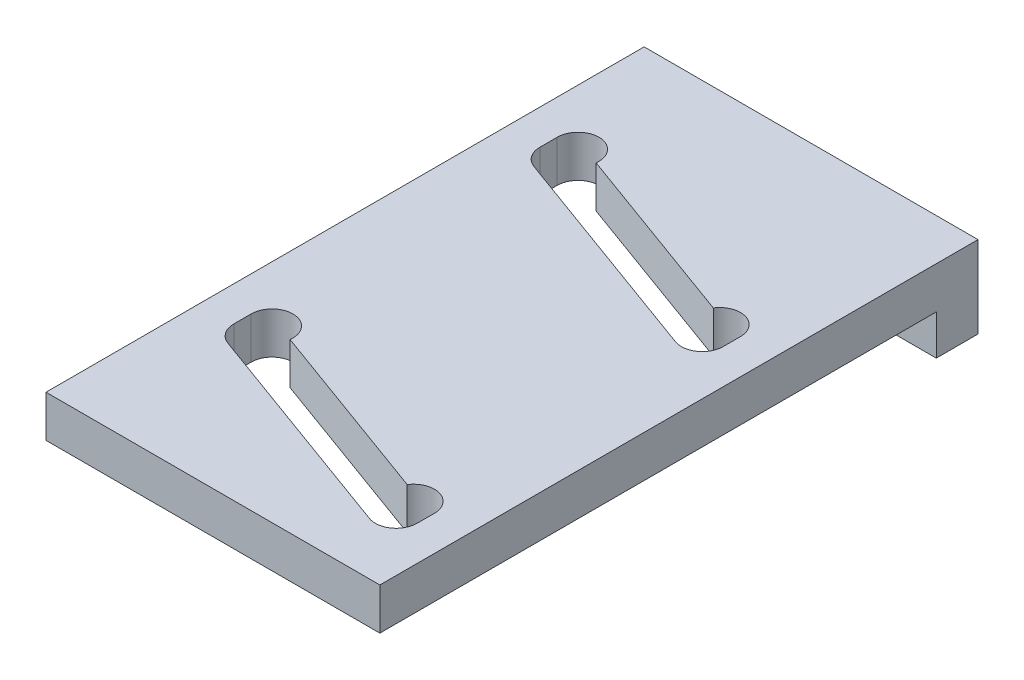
ISO-10303-21;
HEADER;
FILE_DESCRIPTION(('STEP AP214'),'2;1');
FILE_NAME('part.step','',(''),(''),'','','');
FILE_SCHEMA(('AUTOMOTIVE_DESIGN { 1 0 10303 214 1 1 1 1 }'));
ENDSEC;
DATA;
#1=APPLICATION_CONTEXT('core data for automotive mechanical design processes');
#2=APPLICATION_PROTOCOL_DEFINITION('international standard','automotive_design',2000,#1);
#3=PRODUCT_CONTEXT('',#1,'mechanical');
#4=PRODUCT('Part','Part','',(#3));
#5=PRODUCT_RELATED_PRODUCT_CATEGORY('part','',(#4));
#6=PRODUCT_DEFINITION_FORMATION('','',#4);
#7=PRODUCT_DEFINITION_CONTEXT('part definition',#1,'design');
#8=PRODUCT_DEFINITION('design','',#6,#7);
#9=PRODUCT_DEFINITION_SHAPE('','',#8);
#10=(LENGTH_UNIT() NAMED_UNIT(*) SI_UNIT(.MILLI.,.METRE.));
#11=(NAMED_UNIT(*) PLANE_ANGLE_UNIT() SI_UNIT($,.RADIAN.));
#12=(NAMED_UNIT(*) SI_UNIT($,.STERADIAN.) SOLID_ANGLE_UNIT());
#13=UNCERTAINTY_MEASURE_WITH_UNIT(LENGTH_MEASURE(1.E-05),#10,'distance_accuracy_value','');
#14=(GEOMETRIC_REPRESENTATION_CONTEXT(3) GLOBAL_UNCERTAINTY_ASSIGNED_CONTEXT((#13)) GLOBAL_UNIT_ASSIGNED_CONTEXT((#10,
#11,#12)) REPRESENTATION_CONTEXT('',''));
#15=CARTESIAN_POINT('',(0.,0.,0.));
#16=DIRECTION('',(0.,0.,1.));
#17=DIRECTION('',(1.,0.,0.));
#18=AXIS2_PLACEMENT_3D('',#15,#16,#17);
#19=CARTESIAN_POINT('',(-25.4,-4.7625,-34.925));
#20=DIRECTION('',(0.,1.,0.));
#21=DIRECTION('',(0.,0.,1.));
#22=AXIS2_PLACEMENT_3D('',#19,#20,#21);
#23=CYLINDRICAL_SURFACE('',#22,4.7625000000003);
#24=DIRECTION('',(0.,1.,0.));
#25=VECTOR('',#24,1.);
#26=CARTESIAN_POINT('',(-30.1625000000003,-4.7625,-34.925));
#27=LINE('',#26,#25);
#28=CARTESIAN_POINT('',(-30.1625000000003,-4.7625,-34.925));
#29=VERTEX_POINT('',#28);
#30=CARTESIAN_POINT('',(-30.1625000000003,4.7625,-34.925));
#31=VERTEX_POINT('',#30);
#32=EDGE_CURVE('E307',#29,#31,#27,.T.);
#33=ORIENTED_EDGE('',*,*,#32,.T.);
#34=CARTESIAN_POINT('',(-25.4,4.7625,-34.925));
#35=DIRECTION('',(0.,1.,0.));
#36=DIRECTION('',(0.,0.,-1.));
#37=AXIS2_PLACEMENT_3D('',#34,#35,#36);
#38=CIRCLE('',#37,4.7625000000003);
#39=CARTESIAN_POINT('',(-27.0288709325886,4.7625,-30.4497138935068));
#40=VERTEX_POINT('',#39);
#41=EDGE_CURVE('E337',#31,#40,#38,.T.);
#42=ORIENTED_EDGE('',*,*,#41,.T.);
#43=DIRECTION('',(0.,1.,0.));
#44=VECTOR('',#43,1.);
#45=CARTESIAN_POINT('',(-27.0288709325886,-4.7625,-30.4497138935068));
#46=LINE('',#45,#44);
#47=CARTESIAN_POINT('',(-27.0288709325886,-4.7625,-30.4497138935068));
#48=VERTEX_POINT('',#47);
#49=EDGE_CURVE('E354',#48,#40,#46,.T.);
#50=ORIENTED_EDGE('',*,*,#49,.F.);
#51=CARTESIAN_POINT('',(-25.4,-4.7625,-34.925));
#52=DIRECTION('',(0.,1.,0.));
#53=DIRECTION('',(0.,0.,-1.));
#54=AXIS2_PLACEMENT_3D('',#51,#52,#53);
#55=CIRCLE('',#54,4.7625000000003);
#56=EDGE_CURVE('E342',#29,#48,#55,.T.);
#57=ORIENTED_EDGE('',*,*,#56,.F.);
#58=EDGE_LOOP('',(#33,#42,#50,#57));
#59=FACE_BOUND('',#58,.T.);
#60=ADVANCED_FACE('F39',(#59),#23,.F.);
#61=CARTESIAN_POINT('',(-25.4,-4.7625,-104.775));
#62=DIRECTION('',(0.,1.,0.));
#63=DIRECTION('',(0.,0.,1.));
#64=AXIS2_PLACEMENT_3D('',#61,#62,#63);
#65=CYLINDRICAL_SURFACE('',#64,4.76250000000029);
#66=DIRECTION('',(0.,1.,0.));
#67=VECTOR('',#66,1.);
#68=CARTESIAN_POINT('',(-30.1625000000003,-4.7625,-104.775));
#69=LINE('',#68,#67);
#70=CARTESIAN_POINT('',(-30.1625000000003,-4.7625,-104.775));
#71=VERTEX_POINT('',#70);
#72=CARTESIAN_POINT('',(-30.1625000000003,4.7625,-104.775));
#73=VERTEX_POINT('',#72);
#74=EDGE_CURVE('E338',#71,#73,#69,.T.);
#75=ORIENTED_EDGE('',*,*,#74,.T.);
#76=CARTESIAN_POINT('',(-25.4,4.7625,-104.775));
#77=DIRECTION('',(0.,1.,0.));
#78=DIRECTION('',(0.,0.,-1.));
#79=AXIS2_PLACEMENT_3D('',#76,#77,#78);
#80=CIRCLE('',#79,4.76250000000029);
#81=CARTESIAN_POINT('',(-27.0288709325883,4.7625,-100.299713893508));
#82=VERTEX_POINT('',#81);
#83=EDGE_CURVE('E366',#73,#82,#80,.T.);
#84=ORIENTED_EDGE('',*,*,#83,.T.);
#85=DIRECTION('',(0.,1.,0.));
#86=VECTOR('',#85,1.);
#87=CARTESIAN_POINT('',(-27.0288709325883,-4.7625,-100.299713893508));
#88=LINE('',#87,#86);
#89=CARTESIAN_POINT('',(-27.0288709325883,-4.7625,-100.299713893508));
#90=VERTEX_POINT('',#89);
#91=EDGE_CURVE('E380',#90,#82,#88,.T.);
#92=ORIENTED_EDGE('',*,*,#91,.F.);
#93=CARTESIAN_POINT('',(-25.4,-4.7625,-104.775));
#94=DIRECTION('',(0.,1.,0.));
#95=DIRECTION('',(0.,0.,-1.));
#96=AXIS2_PLACEMENT_3D('',#93,#94,#95);
#97=CIRCLE('',#96,4.76250000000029);
#98=EDGE_CURVE('E369',#71,#90,#97,.T.);
#99=ORIENTED_EDGE('',*,*,#98,.F.);
#100=EDGE_LOOP('',(#75,#84,#92,#99));
#101=FACE_BOUND('',#100,.T.);
#102=ADVANCED_FACE('F445',(#101),#65,.F.);
#103=CARTESIAN_POINT('',(-38.1,4.7625,-127.));
#104=DIRECTION('',(1.,0.,0.));
#105=DIRECTION('',(0.,0.,-1.));
#106=AXIS2_PLACEMENT_3D('',#103,#104,#105);
#107=PLANE('',#106);
#108=DIRECTION('',(0.,0.,1.));
#109=VECTOR('',#108,1.);
#110=CARTESIAN_POINT('',(-38.1,-4.7625,-127.));
#111=LINE('',#110,#109);
#112=CARTESIAN_POINT('',(-38.1,-4.7625,-127.));
#113=VERTEX_POINT('',#112);
#114=CARTESIAN_POINT('',(-38.1,-4.7625,0.));
#115=VERTEX_POINT('',#114);
#116=EDGE_CURVE('E391',#113,#115,#111,.T.);
#117=ORIENTED_EDGE('',*,*,#116,.T.);
#118=DIRECTION('',(0.,-1.,0.));
#119=VECTOR('',#118,1.);
#120=CARTESIAN_POINT('',(-38.1,4.7625,0.));
#121=LINE('',#120,#119);
#122=CARTESIAN_POINT('',(-38.1,4.7625,0.));
#123=VERTEX_POINT('',#122);
#124=EDGE_CURVE('E217',#123,#115,#121,.T.);
#125=ORIENTED_EDGE('',*,*,#124,.F.);
#126=DIRECTION('',(0.,0.,1.));
#127=VECTOR('',#126,1.);
#128=CARTESIAN_POINT('',(-38.1,4.7625,-127.));
#129=LINE('',#128,#127);
#130=CARTESIAN_POINT('',(-38.1,4.7625,-136.525));
#131=VERTEX_POINT('',#130);
#132=EDGE_CURVE('E210',#131,#123,#129,.T.);
#133=ORIENTED_EDGE('',*,*,#132,.F.);
#134=DIRECTION('',(0.,1.,0.));
#135=VECTOR('',#134,1.);
#136=CARTESIAN_POINT('',(-38.1,4.7625,-136.525));
#137=LINE('',#136,#135);
#138=CARTESIAN_POINT('',(-38.1,-13.9065,-136.525));
#139=VERTEX_POINT('',#138);
#140=EDGE_CURVE('E215',#139,#131,#137,.T.);
#141=ORIENTED_EDGE('',*,*,#140,.F.);
#142=DIRECTION('',(0.,0.,1.));
#143=VECTOR('',#142,1.);
#144=CARTESIAN_POINT('',(-38.1,-13.9065,-136.525));
#145=LINE('',#144,#143);
#146=CARTESIAN_POINT('',(-38.1,-13.9065,-127.));
#147=VERTEX_POINT('',#146);
#148=EDGE_CURVE('E248',#139,#147,#145,.T.);
#149=ORIENTED_EDGE('',*,*,#148,.T.);
#150=DIRECTION('',(0.,1.,0.));
#151=VECTOR('',#150,1.);
#152=CARTESIAN_POINT('',(-38.1,4.7625,-127.));
#153=LINE('',#152,#151);
#154=EDGE_CURVE('E253',#147,#113,#153,.T.);
#155=ORIENTED_EDGE('',*,*,#154,.T.);
#156=EDGE_LOOP('',(#117,#125,#133,#141,#149,#155));
#157=FACE_BOUND('',#156,.T.);
#158=ADVANCED_FACE('F41',(#157),#107,.F.);
#159=CARTESIAN_POINT('',(-38.1,4.7625,0.));
#160=DIRECTION('',(0.,0.,-1.));
#161=DIRECTION('',(-1.,0.,0.));
#162=AXIS2_PLACEMENT_3D('',#159,#160,#161);
#163=PLANE('',#162);
#164=DIRECTION('',(1.,0.,0.));
#165=VECTOR('',#164,1.);
#166=CARTESIAN_POINT('',(-38.1,-4.7625,0.));
#167=LINE('',#166,#165);
#168=CARTESIAN_POINT('',(38.1,-4.7625,0.));
#169=VERTEX_POINT('',#168);
#170=EDGE_CURVE('E397',#115,#169,#167,.T.);
#171=ORIENTED_EDGE('',*,*,#170,.T.);
#172=DIRECTION('',(0.,-1.,0.));
#173=VECTOR('',#172,1.);
#174=CARTESIAN_POINT('',(38.1,4.7625,0.));
#175=LINE('',#174,#173);
#176=CARTESIAN_POINT('',(38.1,4.7625,0.));
#177=VERTEX_POINT('',#176);
#178=EDGE_CURVE('E396',#177,#169,#175,.T.);
#179=ORIENTED_EDGE('',*,*,#178,.F.);
#180=DIRECTION('',(1.,0.,0.));
#181=VECTOR('',#180,1.);
#182=CARTESIAN_POINT('',(-38.1,4.7625,0.));
#183=LINE('',#182,#181);
#184=EDGE_CURVE('E220',#123,#177,#183,.T.);
#185=ORIENTED_EDGE('',*,*,#184,.F.);
#186=ORIENTED_EDGE('',*,*,#124,.T.);
#187=EDGE_LOOP('',(#171,#179,#185,#186));
#188=FACE_BOUND('',#187,.T.);
#189=ADVANCED_FACE('F438',(#188),#163,.F.);
#190=CARTESIAN_POINT('',(38.1,4.7625,-127.));
#191=DIRECTION('',(-1.,0.,0.));
#192=DIRECTION('',(0.,0.,1.));
#193=AXIS2_PLACEMENT_3D('',#190,#191,#192);
#194=PLANE('',#193);
#195=DIRECTION('',(0.,0.,-1.));
#196=VECTOR('',#195,1.);
#197=CARTESIAN_POINT('',(38.1,-4.7625,-127.));
#198=LINE('',#197,#196);
#199=CARTESIAN_POINT('',(38.1,-4.7625,-127.));
#200=VERTEX_POINT('',#199);
#201=EDGE_CURVE('E399',#169,#200,#198,.T.);
#202=ORIENTED_EDGE('',*,*,#201,.T.);
#203=DIRECTION('',(0.,-1.,0.));
#204=VECTOR('',#203,1.);
#205=CARTESIAN_POINT('',(38.1,4.76249999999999,-127.));
#206=LINE('',#205,#204);
#207=CARTESIAN_POINT('',(38.1,-13.9065,-127.));
#208=VERTEX_POINT('',#207);
#209=EDGE_CURVE('E242',#200,#208,#206,.T.);
#210=ORIENTED_EDGE('',*,*,#209,.T.);
#211=DIRECTION('',(0.,0.,1.));
#212=VECTOR('',#211,1.);
#213=CARTESIAN_POINT('',(38.1,-13.9065,-136.525));
#214=LINE('',#213,#212);
#215=CARTESIAN_POINT('',(38.1,-13.9065,-136.525));
#216=VERTEX_POINT('',#215);
#217=EDGE_CURVE('E258',#216,#208,#214,.T.);
#218=ORIENTED_EDGE('',*,*,#217,.F.);
#219=DIRECTION('',(0.,-1.,0.));
#220=VECTOR('',#219,1.);
#221=CARTESIAN_POINT('',(38.1,4.76249999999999,-136.525));
#222=LINE('',#221,#220);
#223=CARTESIAN_POINT('',(38.1,4.76249999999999,-136.525));
#224=VERTEX_POINT('',#223);
#225=EDGE_CURVE('E231',#224,#216,#222,.T.);
#226=ORIENTED_EDGE('',*,*,#225,.F.);
#227=DIRECTION('',(0.,0.,-1.));
#228=VECTOR('',#227,1.);
#229=CARTESIAN_POINT('',(38.1,4.7625,-127.));
#230=LINE('',#229,#228);
#231=EDGE_CURVE('E227',#177,#224,#230,.T.);
#232=ORIENTED_EDGE('',*,*,#231,.F.);
#233=ORIENTED_EDGE('',*,*,#178,.T.);
#234=EDGE_LOOP('',(#202,#210,#218,#226,#232,#233));
#235=FACE_BOUND('',#234,.T.);
#236=ADVANCED_FACE('F413',(#235),#194,.F.);
#237=CARTESIAN_POINT('',(0.,4.7625,0.));
#238=DIRECTION('',(0.,1.,0.));
#239=DIRECTION('',(0.,0.,1.));
#240=AXIS2_PLACEMENT_3D('',#237,#238,#239);
#241=PLANE('',#240);
#242=CARTESIAN_POINT('',(25.400000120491,4.7625,-20.4040620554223));
#243=DIRECTION('',(0.,1.,0.));
#244=DIRECTION('',(0.,0.,-1.));
#245=AXIS2_PLACEMENT_3D('',#242,#243,#244);
#246=CIRCLE('',#245,4.76250000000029);
#247=CARTESIAN_POINT('',(30.1625001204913,4.7625,-20.4040620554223));
#248=VERTEX_POINT('',#247);
#249=CARTESIAN_POINT('',(21.3846154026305,4.7625,-22.9649392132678));
#250=VERTEX_POINT('',#249);
#251=EDGE_CURVE('E263',#248,#250,#246,.T.);
#252=ORIENTED_EDGE('',*,*,#251,.F.);
#253=DIRECTION('',(0.,0.,-1.));
#254=VECTOR('',#253,1.);
#255=CARTESIAN_POINT('',(30.1625001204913,4.7625,-20.4040620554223));
#256=LINE('',#255,#254);
#257=CARTESIAN_POINT('',(30.1625001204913,4.7625,-16.4353120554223));
#258=VERTEX_POINT('',#257);
#259=EDGE_CURVE('E267',#258,#248,#256,.T.);
#260=ORIENTED_EDGE('',*,*,#259,.F.);
#261=CARTESIAN_POINT('',(25.4,4.7625,-16.4353120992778));
#262=DIRECTION('',(0.,1.,0.));
#263=DIRECTION('',(0.,0.,1.));
#264=AXIS2_PLACEMENT_3D('',#261,#262,#263);
#265=CIRCLE('',#264,4.76250000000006);
#266=CARTESIAN_POINT('',(23.7711290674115,4.7625,-11.9600259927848));
#267=VERTEX_POINT('',#266);
#268=EDGE_CURVE('E359',#267,#258,#265,.T.);
#269=ORIENTED_EDGE('',*,*,#268,.F.);
#270=DIRECTION('',(0.939692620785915,0.,0.342020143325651));
#271=VECTOR('',#270,1.);
#272=CARTESIAN_POINT('',(23.7711290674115,4.7625,-11.9600259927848));
#273=LINE('',#272,#271);
#274=EDGE_CURVE('E356',#40,#267,#273,.T.);
#275=ORIENTED_EDGE('',*,*,#274,.F.);
#276=ORIENTED_EDGE('',*,*,#41,.F.);
#277=DIRECTION('',(0.,0.,1.));
#278=VECTOR('',#277,1.);
#279=CARTESIAN_POINT('',(-30.1625000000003,4.7625,-34.925));
#280=LINE('',#279,#278);
#281=CARTESIAN_POINT('',(-30.1625000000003,4.7625,-38.89375));
#282=VERTEX_POINT('',#281);
#283=EDGE_CURVE('E293',#282,#31,#280,.T.);
#284=ORIENTED_EDGE('',*,*,#283,.F.);
#285=CARTESIAN_POINT('',(-25.4,4.7625,-38.89375));
#286=DIRECTION('',(0.,1.,0.));
#287=DIRECTION('',(0.,0.,-1.));
#288=AXIS2_PLACEMENT_3D('',#285,#286,#287);
#289=CIRCLE('',#288,4.76250000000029);
#290=CARTESIAN_POINT('',(-20.6374999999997,4.7625,-38.89375));
#291=VERTEX_POINT('',#290);
#292=EDGE_CURVE('E302',#291,#282,#289,.T.);
#293=ORIENTED_EDGE('',*,*,#292,.F.);
#294=DIRECTION('',(0.,0.,-1.));
#295=VECTOR('',#294,1.);
#296=CARTESIAN_POINT('',(-20.6374999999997,4.7625,-38.89375));
#297=LINE('',#296,#295);
#298=CARTESIAN_POINT('',(-20.6374999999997,4.7625,-38.259738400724));
#299=VERTEX_POINT('',#298);
#300=EDGE_CURVE('E286',#299,#291,#297,.T.);
#301=ORIENTED_EDGE('',*,*,#300,.F.);
#302=DIRECTION('',(-0.939692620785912,0.,-0.342020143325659));
#303=VECTOR('',#302,1.);
#304=CARTESIAN_POINT('',(-23.7711290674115,4.7625,-39.4002861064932));
#305=LINE('',#304,#303);
#306=EDGE_CURVE('E345',#250,#299,#305,.T.);
#307=ORIENTED_EDGE('',*,*,#306,.F.);
#308=EDGE_LOOP('',(#252,#260,#269,#275,#276,#284,#293,#301,#307));
#309=FACE_BOUND('',#308,.T.);
#310=CARTESIAN_POINT('',(25.400000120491,4.7625,-90.2540620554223));
#311=DIRECTION('',(0.,1.,0.));
#312=DIRECTION('',(0.,0.,-1.));
#313=AXIS2_PLACEMENT_3D('',#310,#311,#312);
#314=CIRCLE('',#313,4.7625000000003);
#315=CARTESIAN_POINT('',(30.1625001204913,4.7625,-90.2540620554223));
#316=VERTEX_POINT('',#315);
#317=CARTESIAN_POINT('',(21.3846154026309,4.7625,-92.8149392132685));
#318=VERTEX_POINT('',#317);
#319=EDGE_CURVE('E273',#316,#318,#314,.T.);
#320=ORIENTED_EDGE('',*,*,#319,.F.);
#321=DIRECTION('',(0.,0.,-1.));
#322=VECTOR('',#321,1.);
#323=CARTESIAN_POINT('',(30.1625001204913,4.7625,-86.2853120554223));
#324=LINE('',#323,#322);
#325=CARTESIAN_POINT('',(30.1625001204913,4.7625,-86.2853120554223));
#326=VERTEX_POINT('',#325);
#327=EDGE_CURVE('E278',#326,#316,#324,.T.);
#328=ORIENTED_EDGE('',*,*,#327,.F.);
#329=CARTESIAN_POINT('',(25.4000000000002,4.7625,-86.2853120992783));
#330=DIRECTION('',(0.,1.,0.));
#331=DIRECTION('',(0.,0.,-1.));
#332=AXIS2_PLACEMENT_3D('',#329,#330,#331);
#333=CIRCLE('',#332,4.7625000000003);
#334=CARTESIAN_POINT('',(23.7711290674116,4.7625,-81.8100259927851));
#335=VERTEX_POINT('',#334);
#336=EDGE_CURVE('E385',#335,#326,#333,.T.);
#337=ORIENTED_EDGE('',*,*,#336,.F.);
#338=DIRECTION('',(0.939692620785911,0.,0.342020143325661));
#339=VECTOR('',#338,1.);
#340=CARTESIAN_POINT('',(23.7711290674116,4.7625,-81.8100259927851));
#341=LINE('',#340,#339);
#342=EDGE_CURVE('E382',#82,#335,#341,.T.);
#343=ORIENTED_EDGE('',*,*,#342,.F.);
#344=ORIENTED_EDGE('',*,*,#83,.F.);
#345=DIRECTION('',(0.,0.,1.));
#346=VECTOR('',#345,1.);
#347=CARTESIAN_POINT('',(-30.1625000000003,4.7625,-108.74375));
#348=LINE('',#347,#346);
#349=CARTESIAN_POINT('',(-30.1625000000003,4.7625,-108.74375));
#350=VERTEX_POINT('',#349);
#351=EDGE_CURVE('E331',#350,#73,#348,.T.);
#352=ORIENTED_EDGE('',*,*,#351,.F.);
#353=CARTESIAN_POINT('',(-25.4,4.7625,-108.74375));
#354=DIRECTION('',(0.,1.,0.));
#355=DIRECTION('',(0.,0.,-1.));
#356=AXIS2_PLACEMENT_3D('',#353,#354,#355);
#357=CIRCLE('',#356,4.7625000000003);
#358=CARTESIAN_POINT('',(-20.6374999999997,4.7625,-108.74375));
#359=VERTEX_POINT('',#358);
#360=EDGE_CURVE('E310',#359,#350,#357,.T.);
#361=ORIENTED_EDGE('',*,*,#360,.F.);
#362=DIRECTION('',(0.,0.,-1.));
#363=VECTOR('',#362,1.);
#364=CARTESIAN_POINT('',(-20.6374999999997,4.7625,-104.775));
#365=LINE('',#364,#363);
#366=CARTESIAN_POINT('',(-20.6374999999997,4.7625,-108.109738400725));
#367=VERTEX_POINT('',#366);
#368=EDGE_CURVE('E321',#367,#359,#365,.T.);
#369=ORIENTED_EDGE('',*,*,#368,.F.);
#370=DIRECTION('',(-0.939692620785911,0.,-0.34202014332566));
#371=VECTOR('',#370,1.);
#372=CARTESIAN_POINT('',(-23.7711290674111,4.7625,-109.250286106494));
#373=LINE('',#372,#371);
#374=EDGE_CURVE('E372',#318,#367,#373,.T.);
#375=ORIENTED_EDGE('',*,*,#374,.F.);
#376=EDGE_LOOP('',(#320,#328,#337,#343,#344,#352,#361,#369,#375));
#377=FACE_BOUND('',#376,.T.);
#378=ORIENTED_EDGE('',*,*,#132,.T.);
#379=ORIENTED_EDGE('',*,*,#184,.T.);
#380=ORIENTED_EDGE('',*,*,#231,.T.);
#381=DIRECTION('',(1.,0.,0.));
#382=VECTOR('',#381,1.);
#383=CARTESIAN_POINT('',(-38.1,4.7625,-136.525));
#384=LINE('',#383,#382);
#385=EDGE_CURVE('E224',#131,#224,#384,.T.);
#386=ORIENTED_EDGE('',*,*,#385,.F.);
#387=EDGE_LOOP('',(#378,#379,#380,#386));
#388=FACE_BOUND('',#387,.T.);
#389=ADVANCED_FACE('F225',(#309,#377,#388),#241,.T.);
#390=CARTESIAN_POINT('',(0.,-4.7625,0.));
#391=DIRECTION('',(0.,1.,0.));
#392=DIRECTION('',(0.,0.,1.));
#393=AXIS2_PLACEMENT_3D('',#390,#391,#392);
#394=PLANE('',#393);
#395=DIRECTION('',(0.,0.,-1.));
#396=VECTOR('',#395,1.);
#397=CARTESIAN_POINT('',(30.1625001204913,-4.7625,-20.4040620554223));
#398=LINE('',#397,#396);
#399=CARTESIAN_POINT('',(30.1625000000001,-4.7625,-16.4353120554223));
#400=VERTEX_POINT('',#399);
#401=CARTESIAN_POINT('',(30.1625001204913,-4.7625,-20.4040620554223));
#402=VERTEX_POINT('',#401);
#403=EDGE_CURVE('E56',#400,#402,#398,.T.);
#404=ORIENTED_EDGE('',*,*,#403,.T.);
#405=CARTESIAN_POINT('',(25.400000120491,-4.7625,-20.4040620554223));
#406=DIRECTION('',(0.,1.,0.));
#407=DIRECTION('',(0.,0.,-1.));
#408=AXIS2_PLACEMENT_3D('',#405,#406,#407);
#409=CIRCLE('',#408,4.76250000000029);
#410=CARTESIAN_POINT('',(21.3846154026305,-4.7625,-22.9649392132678));
#411=VERTEX_POINT('',#410);
#412=EDGE_CURVE('E262',#402,#411,#409,.T.);
#413=ORIENTED_EDGE('',*,*,#412,.T.);
#414=DIRECTION('',(-0.939692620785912,0.,-0.342020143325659));
#415=VECTOR('',#414,1.);
#416=CARTESIAN_POINT('',(-23.7711290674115,-4.7625,-39.4002861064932));
#417=LINE('',#416,#415);
#418=CARTESIAN_POINT('',(-20.6374999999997,-4.7625,-38.259738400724));
#419=VERTEX_POINT('',#418);
#420=EDGE_CURVE('E351',#411,#419,#417,.T.);
#421=ORIENTED_EDGE('',*,*,#420,.T.);
#422=DIRECTION('',(0.,0.,-1.));
#423=VECTOR('',#422,1.);
#424=CARTESIAN_POINT('',(-20.6374999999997,-4.7625,-38.89375));
#425=LINE('',#424,#423);
#426=CARTESIAN_POINT('',(-20.6374999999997,-4.7625,-38.89375));
#427=VERTEX_POINT('',#426);
#428=EDGE_CURVE('E288',#419,#427,#425,.T.);
#429=ORIENTED_EDGE('',*,*,#428,.T.);
#430=CARTESIAN_POINT('',(-25.4,-4.7625,-38.89375));
#431=DIRECTION('',(0.,1.,0.));
#432=DIRECTION('',(0.,0.,-1.));
#433=AXIS2_PLACEMENT_3D('',#430,#431,#432);
#434=CIRCLE('',#433,4.76250000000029);
#435=CARTESIAN_POINT('',(-30.1625000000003,-4.7625,-38.89375));
#436=VERTEX_POINT('',#435);
#437=EDGE_CURVE('E292',#427,#436,#434,.T.);
#438=ORIENTED_EDGE('',*,*,#437,.T.);
#439=DIRECTION('',(0.,0.,1.));
#440=VECTOR('',#439,1.);
#441=CARTESIAN_POINT('',(-30.1625000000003,-4.7625,-34.925));
#442=LINE('',#441,#440);
#443=EDGE_CURVE('E297',#436,#29,#442,.T.);
#444=ORIENTED_EDGE('',*,*,#443,.T.);
#445=ORIENTED_EDGE('',*,*,#56,.T.);
#446=DIRECTION('',(0.939692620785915,0.,0.342020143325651));
#447=VECTOR('',#446,1.);
#448=CARTESIAN_POINT('',(23.7711290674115,-4.7625,-11.9600259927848));
#449=LINE('',#448,#447);
#450=CARTESIAN_POINT('',(23.7711290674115,-4.7625,-11.9600259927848));
#451=VERTEX_POINT('',#450);
#452=EDGE_CURVE('E344',#48,#451,#449,.T.);
#453=ORIENTED_EDGE('',*,*,#452,.T.);
#454=CARTESIAN_POINT('',(25.4,-4.7625,-16.4353120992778));
#455=DIRECTION('',(0.,1.,0.));
#456=DIRECTION('',(0.,0.,1.));
#457=AXIS2_PLACEMENT_3D('',#454,#455,#456);
#458=CIRCLE('',#457,4.76250000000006);
#459=EDGE_CURVE('E348',#451,#400,#458,.T.);
#460=ORIENTED_EDGE('',*,*,#459,.T.);
#461=EDGE_LOOP('',(#404,#413,#421,#429,#438,#444,#445,#453,#460));
#462=FACE_BOUND('',#461,.T.);
#463=DIRECTION('',(0.,0.,-1.));
#464=VECTOR('',#463,1.);
#465=CARTESIAN_POINT('',(30.1625001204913,-4.7625,-86.2853120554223));
#466=LINE('',#465,#464);
#467=CARTESIAN_POINT('',(30.1625000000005,-4.7625,-86.2853120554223));
#468=VERTEX_POINT('',#467);
#469=CARTESIAN_POINT('',(30.1625001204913,-4.7625,-90.2540620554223));
#470=VERTEX_POINT('',#469);
#471=EDGE_CURVE('E64',#468,#470,#466,.T.);
#472=ORIENTED_EDGE('',*,*,#471,.T.);
#473=CARTESIAN_POINT('',(25.400000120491,-4.7625,-90.2540620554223));
#474=DIRECTION('',(0.,1.,0.));
#475=DIRECTION('',(0.,0.,-1.));
#476=AXIS2_PLACEMENT_3D('',#473,#474,#475);
#477=CIRCLE('',#476,4.7625000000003);
#478=CARTESIAN_POINT('',(21.3846154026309,-4.7625,-92.8149392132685));
#479=VERTEX_POINT('',#478);
#480=EDGE_CURVE('E275',#470,#479,#477,.T.);
#481=ORIENTED_EDGE('',*,*,#480,.T.);
#482=DIRECTION('',(-0.939692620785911,0.,-0.34202014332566));
#483=VECTOR('',#482,1.);
#484=CARTESIAN_POINT('',(-23.7711290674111,-4.7625,-109.250286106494));
#485=LINE('',#484,#483);
#486=CARTESIAN_POINT('',(-20.6374999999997,-4.7625,-108.109738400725));
#487=VERTEX_POINT('',#486);
#488=EDGE_CURVE('E378',#479,#487,#485,.T.);
#489=ORIENTED_EDGE('',*,*,#488,.T.);
#490=DIRECTION('',(0.,0.,-1.));
#491=VECTOR('',#490,1.);
#492=CARTESIAN_POINT('',(-20.6374999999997,-4.7625,-104.775));
#493=LINE('',#492,#491);
#494=CARTESIAN_POINT('',(-20.6374999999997,-4.7625,-108.74375));
#495=VERTEX_POINT('',#494);
#496=EDGE_CURVE('E324',#487,#495,#493,.T.);
#497=ORIENTED_EDGE('',*,*,#496,.T.);
#498=CARTESIAN_POINT('',(-25.4,-4.7625,-108.74375));
#499=DIRECTION('',(0.,1.,0.));
#500=DIRECTION('',(0.,0.,-1.));
#501=AXIS2_PLACEMENT_3D('',#498,#499,#500);
#502=CIRCLE('',#501,4.7625000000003);
#503=CARTESIAN_POINT('',(-30.1625000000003,-4.7625,-108.74375));
#504=VERTEX_POINT('',#503);
#505=EDGE_CURVE('E316',#495,#504,#502,.T.);
#506=ORIENTED_EDGE('',*,*,#505,.T.);
#507=DIRECTION('',(0.,0.,1.));
#508=VECTOR('',#507,1.);
#509=CARTESIAN_POINT('',(-30.1625000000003,-4.7625,-108.74375));
#510=LINE('',#509,#508);
#511=EDGE_CURVE('E320',#504,#71,#510,.T.);
#512=ORIENTED_EDGE('',*,*,#511,.T.);
#513=ORIENTED_EDGE('',*,*,#98,.T.);
#514=DIRECTION('',(0.939692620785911,0.,0.342020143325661));
#515=VECTOR('',#514,1.);
#516=CARTESIAN_POINT('',(23.7711290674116,-4.7625,-81.8100259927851));
#517=LINE('',#516,#515);
#518=CARTESIAN_POINT('',(23.7711290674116,-4.7625,-81.8100259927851));
#519=VERTEX_POINT('',#518);
#520=EDGE_CURVE('E371',#90,#519,#517,.T.);
#521=ORIENTED_EDGE('',*,*,#520,.T.);
#522=CARTESIAN_POINT('',(25.4000000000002,-4.7625,-86.2853120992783));
#523=DIRECTION('',(0.,1.,0.));
#524=DIRECTION('',(0.,0.,-1.));
#525=AXIS2_PLACEMENT_3D('',#522,#523,#524);
#526=CIRCLE('',#525,4.7625000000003);
#527=EDGE_CURVE('E375',#519,#468,#526,.T.);
#528=ORIENTED_EDGE('',*,*,#527,.T.);
#529=EDGE_LOOP('',(#472,#481,#489,#497,#506,#512,#513,#521,#528));
#530=FACE_BOUND('',#529,.T.);
#531=ORIENTED_EDGE('',*,*,#116,.F.);
#532=DIRECTION('',(-1.,0.,0.));
#533=VECTOR('',#532,1.);
#534=CARTESIAN_POINT('',(-38.1,-4.7625,-127.));
#535=LINE('',#534,#533);
#536=EDGE_CURVE('E221',#200,#113,#535,.T.);
#537=ORIENTED_EDGE('',*,*,#536,.F.);
#538=ORIENTED_EDGE('',*,*,#201,.F.);
#539=ORIENTED_EDGE('',*,*,#170,.F.);
#540=EDGE_LOOP('',(#531,#537,#538,#539));
#541=FACE_BOUND('',#540,.T.);
#542=ADVANCED_FACE('F419',(#462,#530,#541),#394,.F.);
#543=CARTESIAN_POINT('',(-23.7711290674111,-4.7625,-109.250286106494));
#544=DIRECTION('',(0.34202014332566,0.,-0.939692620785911));
#545=DIRECTION('',(-0.939692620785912,0.,-0.342020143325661));
#546=AXIS2_PLACEMENT_3D('',#543,#544,#545);
#547=PLANE('',#546);
#548=ORIENTED_EDGE('',*,*,#488,.F.);
#549=DIRECTION('',(0.,1.,0.));
#550=VECTOR('',#549,1.);
#551=CARTESIAN_POINT('',(21.3846154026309,-4.7625,-92.8149392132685));
#552=LINE('',#551,#550);
#553=EDGE_CURVE('E48',#479,#318,#552,.T.);
#554=ORIENTED_EDGE('',*,*,#553,.T.);
#555=ORIENTED_EDGE('',*,*,#374,.T.);
#556=DIRECTION('',(0.,-1.,0.));
#557=VECTOR('',#556,1.);
#558=CARTESIAN_POINT('',(-20.6374999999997,-4.7625,-108.109738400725));
#559=LINE('',#558,#557);
#560=EDGE_CURVE('E435',#367,#487,#559,.T.);
#561=ORIENTED_EDGE('',*,*,#560,.T.);
#562=EDGE_LOOP('',(#548,#554,#555,#561));
#563=FACE_BOUND('',#562,.T.);
#564=ADVANCED_FACE('F458',(#563),#547,.F.);
#565=CARTESIAN_POINT('',(25.4000000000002,-4.7625,-86.2853120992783));
#566=DIRECTION('',(0.,1.,0.));
#567=DIRECTION('',(0.,0.,1.));
#568=AXIS2_PLACEMENT_3D('',#565,#566,#567);
#569=CYLINDRICAL_SURFACE('',#568,4.7625000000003);
#570=ORIENTED_EDGE('',*,*,#336,.T.);
#571=DIRECTION('',(0.,1.,0.));
#572=VECTOR('',#571,1.);
#573=CARTESIAN_POINT('',(30.1625001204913,-4.7625,-86.2853120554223));
#574=LINE('',#573,#572);
#575=EDGE_CURVE('E280',#468,#326,#574,.T.);
#576=ORIENTED_EDGE('',*,*,#575,.F.);
#577=ORIENTED_EDGE('',*,*,#527,.F.);
#578=DIRECTION('',(0.,1.,0.));
#579=VECTOR('',#578,1.);
#580=CARTESIAN_POINT('',(23.7711290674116,-4.7625,-81.8100259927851));
#581=LINE('',#580,#579);
#582=EDGE_CURVE('E389',#519,#335,#581,.T.);
#583=ORIENTED_EDGE('',*,*,#582,.T.);
#584=EDGE_LOOP('',(#570,#576,#577,#583));
#585=FACE_BOUND('',#584,.T.);
#586=ADVANCED_FACE('F461',(#585),#569,.F.);
#587=CARTESIAN_POINT('',(23.7711290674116,-4.7625,-81.8100259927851));
#588=DIRECTION('',(-0.342020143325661,0.,0.939692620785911));
#589=DIRECTION('',(0.939692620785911,0.,0.342020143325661));
#590=AXIS2_PLACEMENT_3D('',#587,#588,#589);
#591=PLANE('',#590);
#592=ORIENTED_EDGE('',*,*,#342,.T.);
#593=ORIENTED_EDGE('',*,*,#582,.F.);
#594=ORIENTED_EDGE('',*,*,#520,.F.);
#595=ORIENTED_EDGE('',*,*,#91,.T.);
#596=EDGE_LOOP('',(#592,#593,#594,#595));
#597=FACE_BOUND('',#596,.T.);
#598=ADVANCED_FACE('F465',(#597),#591,.F.);
#599=CARTESIAN_POINT('',(-23.7711290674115,-4.7625,-39.4002861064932));
#600=DIRECTION('',(0.342020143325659,0.,-0.939692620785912));
#601=DIRECTION('',(-0.939692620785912,0.,-0.342020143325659));
#602=AXIS2_PLACEMENT_3D('',#599,#600,#601);
#603=PLANE('',#602);
#604=ORIENTED_EDGE('',*,*,#420,.F.);
#605=DIRECTION('',(0.,1.,0.));
#606=VECTOR('',#605,1.);
#607=CARTESIAN_POINT('',(21.3846154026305,-4.7625,-22.9649392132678));
#608=LINE('',#607,#606);
#609=EDGE_CURVE('E11',#411,#250,#608,.T.);
#610=ORIENTED_EDGE('',*,*,#609,.T.);
#611=ORIENTED_EDGE('',*,*,#306,.T.);
#612=DIRECTION('',(0.,-1.,0.));
#613=VECTOR('',#612,1.);
#614=CARTESIAN_POINT('',(-20.6374999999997,-4.7625,-38.259738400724));
#615=LINE('',#614,#613);
#616=EDGE_CURVE('E431',#299,#419,#615,.T.);
#617=ORIENTED_EDGE('',*,*,#616,.T.);
#618=EDGE_LOOP('',(#604,#610,#611,#617));
#619=FACE_BOUND('',#618,.T.);
#620=ADVANCED_FACE('F468',(#619),#603,.F.);
#621=CARTESIAN_POINT('',(25.4,-4.7625,-16.4353120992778));
#622=DIRECTION('',(0.,1.,0.));
#623=DIRECTION('',(0.,0.,1.));
#624=AXIS2_PLACEMENT_3D('',#621,#622,#623);
#625=CYLINDRICAL_SURFACE('',#624,4.76250000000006);
#626=ORIENTED_EDGE('',*,*,#268,.T.);
#627=DIRECTION('',(0.,1.,0.));
#628=VECTOR('',#627,1.);
#629=CARTESIAN_POINT('',(30.1625001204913,-4.7625,-16.4353120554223));
#630=LINE('',#629,#628);
#631=EDGE_CURVE('E266',#400,#258,#630,.T.);
#632=ORIENTED_EDGE('',*,*,#631,.F.);
#633=ORIENTED_EDGE('',*,*,#459,.F.);
#634=DIRECTION('',(0.,1.,0.));
#635=VECTOR('',#634,1.);
#636=CARTESIAN_POINT('',(23.7711290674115,-4.7625,-11.9600259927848));
#637=LINE('',#636,#635);
#638=EDGE_CURVE('E364',#451,#267,#637,.T.);
#639=ORIENTED_EDGE('',*,*,#638,.T.);
#640=EDGE_LOOP('',(#626,#632,#633,#639));
#641=FACE_BOUND('',#640,.T.);
#642=ADVANCED_FACE('F522',(#641),#625,.F.);
#643=CARTESIAN_POINT('',(23.7711290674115,-4.7625,-11.9600259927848));
#644=DIRECTION('',(-0.34202014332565,0.,0.939692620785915));
#645=DIRECTION('',(0.939692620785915,0.,0.34202014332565));
#646=AXIS2_PLACEMENT_3D('',#643,#644,#645);
#647=PLANE('',#646);
#648=ORIENTED_EDGE('',*,*,#274,.T.);
#649=ORIENTED_EDGE('',*,*,#638,.F.);
#650=ORIENTED_EDGE('',*,*,#452,.F.);
#651=ORIENTED_EDGE('',*,*,#49,.T.);
#652=EDGE_LOOP('',(#648,#649,#650,#651));
#653=FACE_BOUND('',#652,.T.);
#654=ADVANCED_FACE('F456',(#653),#647,.F.);
#655=CARTESIAN_POINT('',(-20.6374999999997,-4.7625,-104.775));
#656=DIRECTION('',(1.,0.,0.));
#657=DIRECTION('',(0.,0.,-1.));
#658=AXIS2_PLACEMENT_3D('',#655,#656,#657);
#659=PLANE('',#658);
#660=ORIENTED_EDGE('',*,*,#368,.T.);
#661=DIRECTION('',(0.,1.,0.));
#662=VECTOR('',#661,1.);
#663=CARTESIAN_POINT('',(-20.6374999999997,-4.7625,-108.74375));
#664=LINE('',#663,#662);
#665=EDGE_CURVE('E334',#495,#359,#664,.T.);
#666=ORIENTED_EDGE('',*,*,#665,.F.);
#667=ORIENTED_EDGE('',*,*,#496,.F.);
#668=ORIENTED_EDGE('',*,*,#560,.F.);
#669=EDGE_LOOP('',(#660,#666,#667,#668));
#670=FACE_BOUND('',#669,.T.);
#671=ADVANCED_FACE('F499',(#670),#659,.F.);
#672=CARTESIAN_POINT('',(-25.4,-4.7625,-108.74375));
#673=DIRECTION('',(0.,1.,0.));
#674=DIRECTION('',(0.,0.,1.));
#675=AXIS2_PLACEMENT_3D('',#672,#673,#674);
#676=CYLINDRICAL_SURFACE('',#675,4.7625000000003);
#677=ORIENTED_EDGE('',*,*,#360,.T.);
#678=DIRECTION('',(0.,1.,0.));
#679=VECTOR('',#678,1.);
#680=CARTESIAN_POINT('',(-30.1625000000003,-4.7625,-108.74375));
#681=LINE('',#680,#679);
#682=EDGE_CURVE('E327',#504,#350,#681,.T.);
#683=ORIENTED_EDGE('',*,*,#682,.F.);
#684=ORIENTED_EDGE('',*,*,#505,.F.);
#685=ORIENTED_EDGE('',*,*,#665,.T.);
#686=EDGE_LOOP('',(#677,#683,#684,#685));
#687=FACE_BOUND('',#686,.T.);
#688=ADVANCED_FACE('F503',(#687),#676,.F.);
#689=CARTESIAN_POINT('',(-30.1625000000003,-4.7625,-108.74375));
#690=DIRECTION('',(-1.,0.,0.));
#691=DIRECTION('',(0.,0.,1.));
#692=AXIS2_PLACEMENT_3D('',#689,#690,#691);
#693=PLANE('',#692);
#694=ORIENTED_EDGE('',*,*,#351,.T.);
#695=ORIENTED_EDGE('',*,*,#74,.F.);
#696=ORIENTED_EDGE('',*,*,#511,.F.);
#697=ORIENTED_EDGE('',*,*,#682,.T.);
#698=EDGE_LOOP('',(#694,#695,#696,#697));
#699=FACE_BOUND('',#698,.T.);
#700=ADVANCED_FACE('F507',(#699),#693,.F.);
#701=CARTESIAN_POINT('',(-20.6374999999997,-4.7625,-38.89375));
#702=DIRECTION('',(1.,0.,0.));
#703=DIRECTION('',(0.,0.,-1.));
#704=AXIS2_PLACEMENT_3D('',#701,#702,#703);
#705=PLANE('',#704);
#706=ORIENTED_EDGE('',*,*,#300,.T.);
#707=DIRECTION('',(0.,1.,0.));
#708=VECTOR('',#707,1.);
#709=CARTESIAN_POINT('',(-20.6374999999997,-4.7625,-38.89375));
#710=LINE('',#709,#708);
#711=EDGE_CURVE('E300',#427,#291,#710,.T.);
#712=ORIENTED_EDGE('',*,*,#711,.F.);
#713=ORIENTED_EDGE('',*,*,#428,.F.);
#714=ORIENTED_EDGE('',*,*,#616,.F.);
#715=EDGE_LOOP('',(#706,#712,#713,#714));
#716=FACE_BOUND('',#715,.T.);
#717=ADVANCED_FACE('F509',(#716),#705,.F.);
#718=CARTESIAN_POINT('',(-30.1625000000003,-4.7625,-34.925));
#719=DIRECTION('',(-1.,0.,0.));
#720=DIRECTION('',(0.,0.,1.));
#721=AXIS2_PLACEMENT_3D('',#718,#719,#720);
#722=PLANE('',#721);
#723=ORIENTED_EDGE('',*,*,#283,.T.);
#724=ORIENTED_EDGE('',*,*,#32,.F.);
#725=ORIENTED_EDGE('',*,*,#443,.F.);
#726=DIRECTION('',(0.,1.,0.));
#727=VECTOR('',#726,1.);
#728=CARTESIAN_POINT('',(-30.1625000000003,-4.7625,-38.89375));
#729=LINE('',#728,#727);
#730=EDGE_CURVE('E311',#436,#282,#729,.T.);
#731=ORIENTED_EDGE('',*,*,#730,.T.);
#732=EDGE_LOOP('',(#723,#724,#725,#731));
#733=FACE_BOUND('',#732,.T.);
#734=ADVANCED_FACE('F515',(#733),#722,.F.);
#735=CARTESIAN_POINT('',(-25.4,-4.7625,-38.89375));
#736=DIRECTION('',(0.,1.,0.));
#737=DIRECTION('',(0.,0.,1.));
#738=AXIS2_PLACEMENT_3D('',#735,#736,#737);
#739=CYLINDRICAL_SURFACE('',#738,4.76250000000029);
#740=ORIENTED_EDGE('',*,*,#292,.T.);
#741=ORIENTED_EDGE('',*,*,#730,.F.);
#742=ORIENTED_EDGE('',*,*,#437,.F.);
#743=ORIENTED_EDGE('',*,*,#711,.T.);
#744=EDGE_LOOP('',(#740,#741,#742,#743));
#745=FACE_BOUND('',#744,.T.);
#746=ADVANCED_FACE('F548',(#745),#739,.F.);
#747=CARTESIAN_POINT('',(25.400000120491,-4.7625,-90.2540620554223));
#748=DIRECTION('',(0.,1.,0.));
#749=DIRECTION('',(0.,0.,1.));
#750=AXIS2_PLACEMENT_3D('',#747,#748,#749);
#751=CYLINDRICAL_SURFACE('',#750,4.7625000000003);
#752=ORIENTED_EDGE('',*,*,#480,.F.);
#753=DIRECTION('',(0.,1.,0.));
#754=VECTOR('',#753,1.);
#755=CARTESIAN_POINT('',(30.1625001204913,-4.7625,-90.2540620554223));
#756=LINE('',#755,#754);
#757=EDGE_CURVE('E284',#470,#316,#756,.T.);
#758=ORIENTED_EDGE('',*,*,#757,.T.);
#759=ORIENTED_EDGE('',*,*,#319,.T.);
#760=ORIENTED_EDGE('',*,*,#553,.F.);
#761=EDGE_LOOP('',(#752,#758,#759,#760));
#762=FACE_BOUND('',#761,.T.);
#763=ADVANCED_FACE('F493',(#762),#751,.F.);
#764=CARTESIAN_POINT('',(30.1625001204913,-4.7625,-86.2853120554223));
#765=DIRECTION('',(1.,0.,0.));
#766=DIRECTION('',(0.,0.,-1.));
#767=AXIS2_PLACEMENT_3D('',#764,#765,#766);
#768=PLANE('',#767);
#769=ORIENTED_EDGE('',*,*,#327,.T.);
#770=ORIENTED_EDGE('',*,*,#757,.F.);
#771=ORIENTED_EDGE('',*,*,#471,.F.);
#772=ORIENTED_EDGE('',*,*,#575,.T.);
#773=EDGE_LOOP('',(#769,#770,#771,#772));
#774=FACE_BOUND('',#773,.T.);
#775=ADVANCED_FACE('F491',(#774),#768,.F.);
#776=CARTESIAN_POINT('',(25.400000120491,-4.7625,-20.4040620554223));
#777=DIRECTION('',(0.,1.,0.));
#778=DIRECTION('',(0.,0.,1.));
#779=AXIS2_PLACEMENT_3D('',#776,#777,#778);
#780=CYLINDRICAL_SURFACE('',#779,4.76250000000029);
#781=ORIENTED_EDGE('',*,*,#412,.F.);
#782=DIRECTION('',(0.,1.,0.));
#783=VECTOR('',#782,1.);
#784=CARTESIAN_POINT('',(30.1625001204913,-4.7625,-20.4040620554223));
#785=LINE('',#784,#783);
#786=EDGE_CURVE('E271',#402,#248,#785,.T.);
#787=ORIENTED_EDGE('',*,*,#786,.T.);
#788=ORIENTED_EDGE('',*,*,#251,.T.);
#789=ORIENTED_EDGE('',*,*,#609,.F.);
#790=EDGE_LOOP('',(#781,#787,#788,#789));
#791=FACE_BOUND('',#790,.T.);
#792=ADVANCED_FACE('F540',(#791),#780,.F.);
#793=CARTESIAN_POINT('',(30.1625001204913,-4.7625,-20.4040620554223));
#794=DIRECTION('',(1.,0.,0.));
#795=DIRECTION('',(0.,0.,-1.));
#796=AXIS2_PLACEMENT_3D('',#793,#794,#795);
#797=PLANE('',#796);
#798=ORIENTED_EDGE('',*,*,#259,.T.);
#799=ORIENTED_EDGE('',*,*,#786,.F.);
#800=ORIENTED_EDGE('',*,*,#403,.F.);
#801=ORIENTED_EDGE('',*,*,#631,.T.);
#802=EDGE_LOOP('',(#798,#799,#800,#801));
#803=FACE_BOUND('',#802,.T.);
#804=ADVANCED_FACE('F537',(#803),#797,.F.);
#805=CARTESIAN_POINT('',(-38.1,-13.9065,-136.525));
#806=DIRECTION('',(0.,1.,0.));
#807=DIRECTION('',(-1.,0.,0.));
#808=AXIS2_PLACEMENT_3D('',#805,#806,#807);
#809=PLANE('',#808);
#810=DIRECTION('',(-1.,0.,0.));
#811=VECTOR('',#810,1.);
#812=CARTESIAN_POINT('',(-38.1,-13.9065,-127.));
#813=LINE('',#812,#811);
#814=EDGE_CURVE('E238',#208,#147,#813,.T.);
#815=ORIENTED_EDGE('',*,*,#814,.T.);
#816=ORIENTED_EDGE('',*,*,#148,.F.);
#817=DIRECTION('',(-1.,0.,0.));
#818=VECTOR('',#817,1.);
#819=CARTESIAN_POINT('',(-38.1,-13.9065,-136.525));
#820=LINE('',#819,#818);
#821=EDGE_CURVE('E235',#216,#139,#820,.T.);
#822=ORIENTED_EDGE('',*,*,#821,.F.);
#823=ORIENTED_EDGE('',*,*,#217,.T.);
#824=EDGE_LOOP('',(#815,#816,#822,#823));
#825=FACE_BOUND('',#824,.T.);
#826=ADVANCED_FACE('F425',(#825),#809,.F.);
#827=CARTESIAN_POINT('',(0.,0.,-136.525));
#828=DIRECTION('',(0.,0.,1.));
#829=DIRECTION('',(1.,0.,0.));
#830=AXIS2_PLACEMENT_3D('',#827,#828,#829);
#831=PLANE('',#830);
#832=ORIENTED_EDGE('',*,*,#140,.T.);
#833=ORIENTED_EDGE('',*,*,#385,.T.);
#834=ORIENTED_EDGE('',*,*,#225,.T.);
#835=ORIENTED_EDGE('',*,*,#821,.T.);
#836=EDGE_LOOP('',(#832,#833,#834,#835));
#837=FACE_BOUND('',#836,.T.);
#838=ADVANCED_FACE('F233',(#837),#831,.F.);
#839=CARTESIAN_POINT('',(0.,0.,-127.));
#840=DIRECTION('',(0.,0.,1.));
#841=DIRECTION('',(1.,0.,0.));
#842=AXIS2_PLACEMENT_3D('',#839,#840,#841);
#843=PLANE('',#842);
#844=ORIENTED_EDGE('',*,*,#209,.F.);
#845=ORIENTED_EDGE('',*,*,#536,.T.);
#846=ORIENTED_EDGE('',*,*,#154,.F.);
#847=ORIENTED_EDGE('',*,*,#814,.F.);
#848=EDGE_LOOP('',(#844,#845,#846,#847));
#849=FACE_BOUND('',#848,.T.);
#850=ADVANCED_FACE('F423',(#849),#843,.T.);
#851=CLOSED_SHELL('',(#60,#102,#158,#189,#236,#389,#542,#564,#586,#598,#620,#642,#654,#671,#688,
#700,#717,#734,#746,#763,#775,#792,#804,#826,#838,#850));
#852=MANIFOLD_SOLID_BREP('B2',#851);
#853=ADVANCED_BREP_SHAPE_REPRESENTATION('',(#18,#852),#14);
#854=SHAPE_DEFINITION_REPRESENTATION(#9,#853);
ENDSEC;
END-ISO-10303-21;
